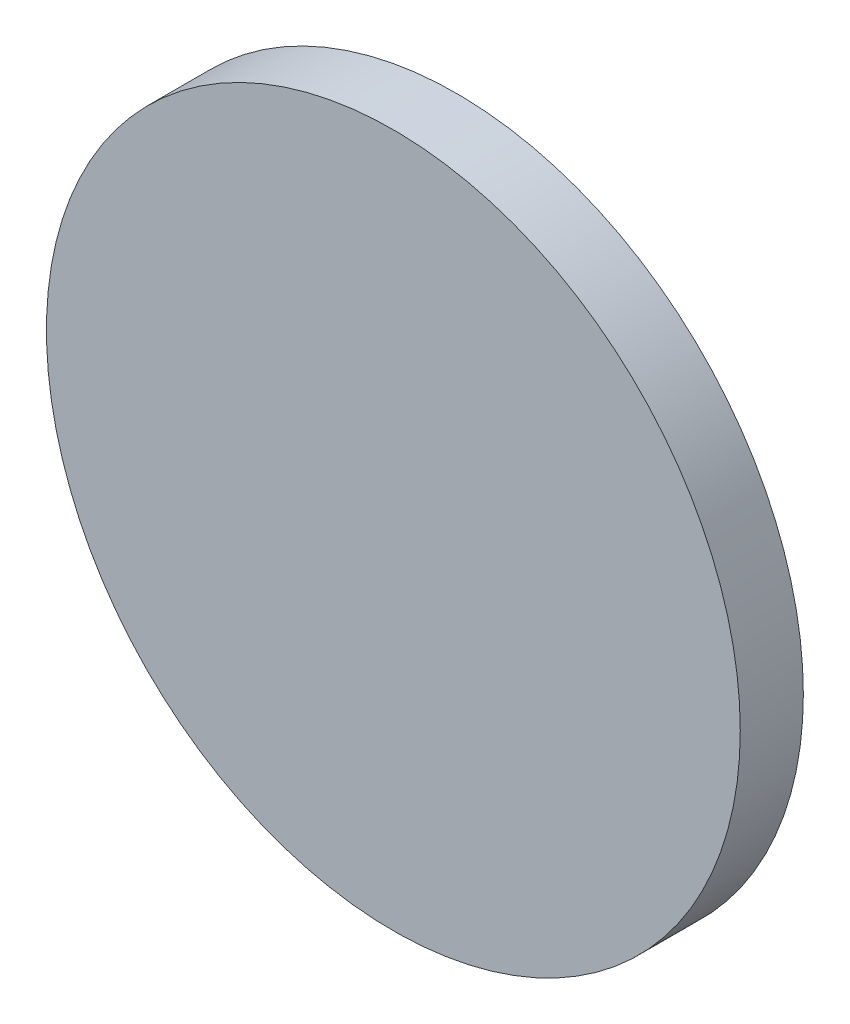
ISO-10303-21;
HEADER;
FILE_DESCRIPTION(('STEP AP214'),'2;1');
FILE_NAME('part.step','',(''),(''),'','','');
FILE_SCHEMA(('AUTOMOTIVE_DESIGN { 1 0 10303 214 1 1 1 1 }'));
ENDSEC;
DATA;
#1=APPLICATION_CONTEXT('core data for automotive mechanical design processes');
#2=APPLICATION_PROTOCOL_DEFINITION('international standard','automotive_design',2000,#1);
#3=PRODUCT_CONTEXT('',#1,'mechanical');
#4=PRODUCT('Part','Part','',(#3));
#5=PRODUCT_RELATED_PRODUCT_CATEGORY('part','',(#4));
#6=PRODUCT_DEFINITION_FORMATION('','',#4);
#7=PRODUCT_DEFINITION_CONTEXT('part definition',#1,'design');
#8=PRODUCT_DEFINITION('design','',#6,#7);
#9=PRODUCT_DEFINITION_SHAPE('','',#8);
#10=(LENGTH_UNIT() NAMED_UNIT(*) SI_UNIT(.MILLI.,.METRE.));
#11=(NAMED_UNIT(*) PLANE_ANGLE_UNIT() SI_UNIT($,.RADIAN.));
#12=(NAMED_UNIT(*) SI_UNIT($,.STERADIAN.) SOLID_ANGLE_UNIT());
#13=UNCERTAINTY_MEASURE_WITH_UNIT(LENGTH_MEASURE(1.E-05),#10,'distance_accuracy_value','');
#14=(GEOMETRIC_REPRESENTATION_CONTEXT(3) GLOBAL_UNCERTAINTY_ASSIGNED_CONTEXT((#13)) GLOBAL_UNIT_ASSIGNED_CONTEXT((#10,
#11,#12)) REPRESENTATION_CONTEXT('',''));
#15=CARTESIAN_POINT('',(0.,0.,0.));
#16=DIRECTION('',(0.,0.,1.));
#17=DIRECTION('',(1.,0.,0.));
#18=AXIS2_PLACEMENT_3D('',#15,#16,#17);
#19=CARTESIAN_POINT('',(0.,0.,12.));
#20=DIRECTION('',(0.,0.,-1.));
#21=DIRECTION('',(-1.,0.,0.));
#22=AXIS2_PLACEMENT_3D('',#19,#20,#21);
#23=CYLINDRICAL_SURFACE('',#22,5.);
#24=CARTESIAN_POINT('',(0.,0.,12.));
#25=DIRECTION('',(0.,0.,1.));
#26=DIRECTION('',(1.,0.,0.));
#27=AXIS2_PLACEMENT_3D('',#24,#25,#26);
#28=CIRCLE('',#27,5.);
#29=CARTESIAN_POINT('',(5.,0.,12.));
#30=VERTEX_POINT('',#29);
#31=EDGE_CURVE('E10',#30,#30,#28,.T.);
#32=ORIENTED_EDGE('',*,*,#31,.F.);
#33=EDGE_LOOP('',(#32));
#34=FACE_BOUND('',#33,.T.);
#35=CARTESIAN_POINT('',(0.,0.,0.));
#36=DIRECTION('',(0.,0.,1.));
#37=DIRECTION('',(1.,0.,0.));
#38=AXIS2_PLACEMENT_3D('',#35,#36,#37);
#39=CIRCLE('',#38,5.);
#40=CARTESIAN_POINT('',(5.,0.,0.));
#41=VERTEX_POINT('',#40);
#42=EDGE_CURVE('E37',#41,#41,#39,.T.);
#43=ORIENTED_EDGE('',*,*,#42,.T.);
#44=EDGE_LOOP('',(#43));
#45=FACE_BOUND('',#44,.T.);
#46=ADVANCED_FACE('F34',(#34,#45),#23,.T.);
#47=CARTESIAN_POINT('',(0.,0.,0.));
#48=DIRECTION('',(0.,0.,1.));
#49=DIRECTION('',(1.,0.,0.));
#50=AXIS2_PLACEMENT_3D('',#47,#48,#49);
#51=PLANE('',#50);
#52=ORIENTED_EDGE('',*,*,#42,.F.);
#53=EDGE_LOOP('',(#52));
#54=FACE_BOUND('',#53,.T.);
#55=ADVANCED_FACE('F57',(#54),#51,.F.);
#56=CARTESIAN_POINT('',(0.,0.,22.));
#57=DIRECTION('',(0.,0.,-1.));
#58=DIRECTION('',(-1.,0.,0.));
#59=AXIS2_PLACEMENT_3D('',#56,#57,#58);
#60=CYLINDRICAL_SURFACE('',#59,55.);
#61=CARTESIAN_POINT('',(0.,0.,22.));
#62=DIRECTION('',(0.,0.,1.));
#63=DIRECTION('',(1.,0.,0.));
#64=AXIS2_PLACEMENT_3D('',#61,#62,#63);
#65=CIRCLE('',#64,55.);
#66=CARTESIAN_POINT('',(55.,0.,22.));
#67=VERTEX_POINT('',#66);
#68=EDGE_CURVE('E44',#67,#67,#65,.T.);
#69=ORIENTED_EDGE('',*,*,#68,.F.);
#70=EDGE_LOOP('',(#69));
#71=FACE_BOUND('',#70,.T.);
#72=CARTESIAN_POINT('',(0.,0.,12.));
#73=DIRECTION('',(0.,0.,1.));
#74=DIRECTION('',(1.,0.,0.));
#75=AXIS2_PLACEMENT_3D('',#72,#73,#74);
#76=CIRCLE('',#75,55.);
#77=CARTESIAN_POINT('',(55.,0.,12.));
#78=VERTEX_POINT('',#77);
#79=EDGE_CURVE('E46',#78,#78,#76,.T.);
#80=ORIENTED_EDGE('',*,*,#79,.T.);
#81=EDGE_LOOP('',(#80));
#82=FACE_BOUND('',#81,.T.);
#83=ADVANCED_FACE('F54',(#71,#82),#60,.T.);
#84=CARTESIAN_POINT('',(0.,0.,22.));
#85=DIRECTION('',(0.,0.,1.));
#86=DIRECTION('',(1.,0.,0.));
#87=AXIS2_PLACEMENT_3D('',#84,#85,#86);
#88=PLANE('',#87);
#89=ORIENTED_EDGE('',*,*,#68,.T.);
#90=EDGE_LOOP('',(#89));
#91=FACE_BOUND('',#90,.T.);
#92=ADVANCED_FACE('F52',(#91),#88,.T.);
#93=CARTESIAN_POINT('',(0.,0.,12.));
#94=DIRECTION('',(0.,0.,1.));
#95=DIRECTION('',(1.,0.,0.));
#96=AXIS2_PLACEMENT_3D('',#93,#94,#95);
#97=PLANE('',#96);
#98=ORIENTED_EDGE('',*,*,#31,.T.);
#99=EDGE_LOOP('',(#98));
#100=FACE_BOUND('',#99,.T.);
#101=ORIENTED_EDGE('',*,*,#79,.F.);
#102=EDGE_LOOP('',(#101));
#103=FACE_BOUND('',#102,.T.);
#104=ADVANCED_FACE('F61',(#100,#103),#97,.F.);
#105=CLOSED_SHELL('',(#46,#55,#83,#92,#104));
#106=MANIFOLD_SOLID_BREP('B2',#105);
#107=ADVANCED_BREP_SHAPE_REPRESENTATION('',(#18,#106),#14);
#108=SHAPE_DEFINITION_REPRESENTATION(#9,#107);
ENDSEC;
END-ISO-10303-21;
